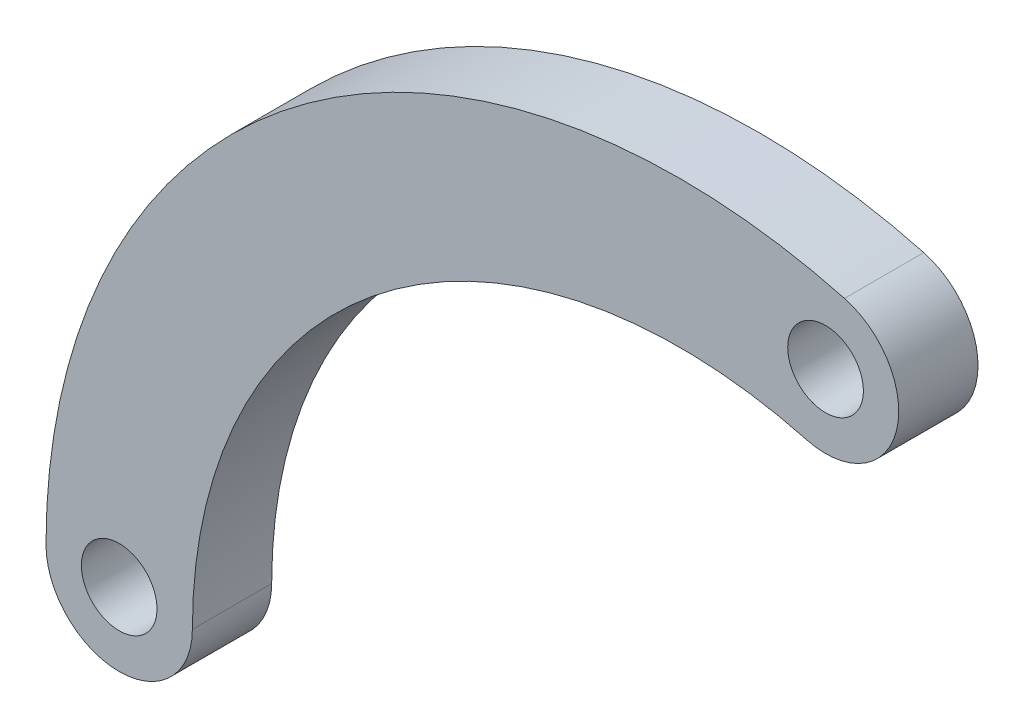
from build123d import *

# Parameters (mm, degrees)
ESQUISSE1_R      = 3.1
EXTRUSION1_DEPTH = 6.5


with BuildPart() as part:
    # Esquisse1 → Extrusion1 (new body)
    with BuildSketch(Plane.XY):
        with BuildLine():
            ThreePointArc((-52, 0), (-31.655594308, 41.254373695), (13.458590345, 50.228142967))
            ThreePointArc((13.458590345, 50.228142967), (17.701231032, 42.879673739), (10.352761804, 38.637033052))
            ThreePointArc((10.352761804, 38.637033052), (-24.35045716, 31.734133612), (-40, 0))
            ThreePointArc((-40, 0), (-46, -6), (-52, 0))
        make_face()
        with Locations(Location((11.905676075, 44.432588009, 0), (0, 0, 180))):
            Circle(ESQUISSE1_R, mode=Mode.SUBTRACT)
        with Locations(Location((-46, 0, 0), (0, 0, 180))):
            Circle(ESQUISSE1_R, mode=Mode.SUBTRACT)
    extrude(amount=EXTRUSION1_DEPTH)


solid = part.part
